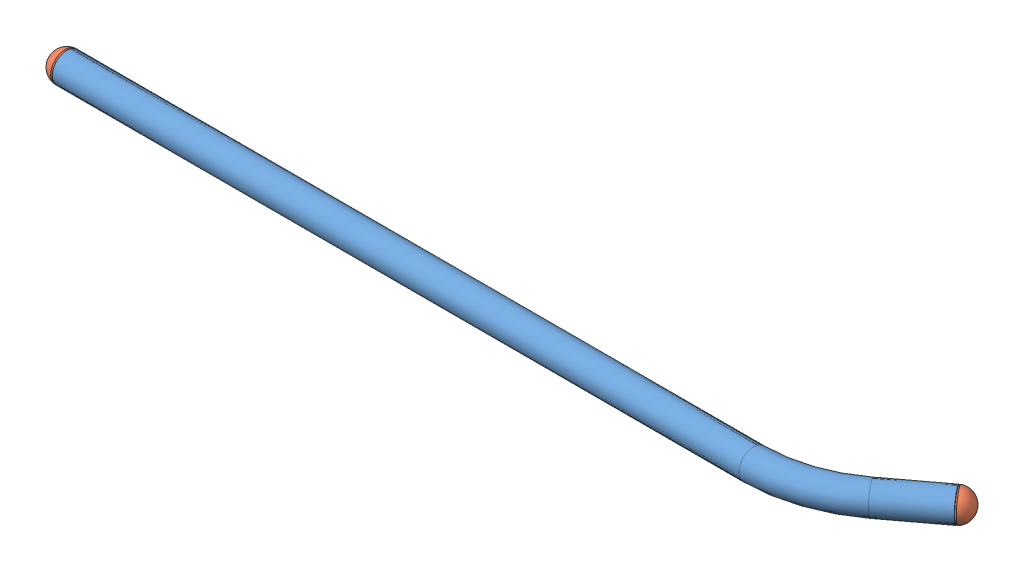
SolidWorks assembly train patin.SLDASM, configuration Default (file format 4100). Lengths in mm.
Overall size (58.4 2 6.9).
3 component instances, 2 part files, 4 mates.
Components (placement in the parent):
- train tube-1: train tube.SLDPRT [Default] at origin size (56.6 2 6.3)
- train bouchon tube-1: train bouchon tube.SLDPRT [Default] at (-1 0 0) size (3 2 2)
- train bouchon tube-2: train bouchon tube.SLDPRT [Default] at (56.8 0 -5.1) x (-0.8 0 0.6) z (-0.6 0 -0.8) size (3 2 2)
Mates (geometry in assembly coordinates):
- Coïncidente1: coincident anti-aligned: plane of train tube-1 through (0 0 0) normal (-1 0 0); plane of train bouchon tube-1 through (0 0.8 0) normal (1 0 0)
- Coaxiale1: concentric aligned: cylinder of train tube-1 through (46.6667 0 0) axis (-1 0 0) radius 0.8; cylinder of train bouchon tube-1 through (-1 0 0) axis (-1 0 0) radius 0.8
- Coïncidente2: coincident: plane of train tube-1 through (56 0 -4.5) normal (0.8 0 -0.6); plane of train bouchon tube-2 through (56 0.8 -4.5) normal (-0.8 0 0.6)
- Coaxiale2: concentric aligned: cylinder of train tube-1 through (52.6667 0 -2) axis (0.8 0 -0.6) radius 0.8; cylinder of train bouchon tube-2 through (56.8 0 -5.1) axis (0.8 0 -0.6) radius 0.8
